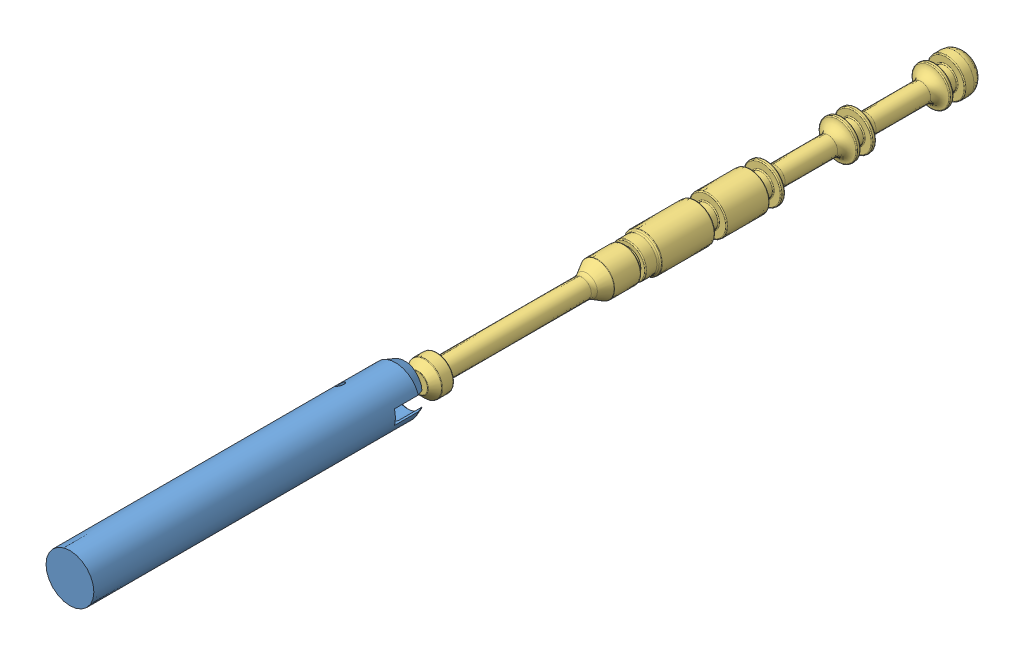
SolidWorks assembly Assem4.SLDASM, configuration Default (file format 12000). Lengths in mm.
Overall size (6.86 5.66 92.83).
4 component instances, 4 part files, 7 mates.
Components (placement in the parent):
- OffCenterPart1-1: OffCenterPart1.SLDPRT [Default] at (13.9286 17.793 17.8707) size (5 5 35.13)
- ExtractorPart2-1: ExtractorPart2.SLDPRT [Default] at (12.4522 18.793 19.3761) x (0.05161 0 0.998667) z (0 -1 0) size (13.89 2.48 2)
- P-201428-12revF-1: P-201428-12revF.sldprt [5.7] at (14.4286 17.793 -27.8121) x (0 0 -1) z (0.717176 -0.696892 0) size (57 4 4)
- 7487N11_Precision Stainless Steel Ball Bearing-1: 7487N11_Precision Stainless Steel Ball Bearing.SLDPRT [7487N11] at (12.4157 17.793 27.3886) x (-0.890134 0 -0.4557) z (0 1 0) size (3 3 1)
Mates (geometry in assembly coordinates):
- Width1: width anti-aligned: plane of ExtractorPart2-1 through (12.4157 18.793 27.3886) normal (0 1 0); plane of ExtractorPart2-1 through (12.4157 16.793 27.3886) normal (0 -1 0); plane of OffCenterPart1-1 through (11.2016 18.343 47.8707) normal (0 -1 0); plane of OffCenterPart1-1 through (12.7016 17.243 47.8707) normal (0 1 0)
- Concentric2: concentric aligned: cylinder of OffCenterPart1-1 through (14.4286 17.793 21.3707) axis (0 0 -1) radius 1.8125; cylinder of P-201428-12revF-1 through (14.4286 17.793 -27.8121) axis (0 0 -1) radius 1.7859
- Concentric3: concentric aligned: cylinder of OffCenterPart1-1 through (12.6586 15.293 23.3707) axis (0 1 0) radius 0.3969; cylinder of ExtractorPart2-1 through (12.6586 16.793 23.3707) axis (0 1 0) radius 0.3969
- Coincident3: coincident aligned: plane of ExtractorPart2-1 through (12.4157 18.793 27.3886) normal (0 1 0); plane of 57155K339_Stainless Steel Ball Bearing-1 through (9.3054 18.293 24.3787) normal (0 1 0)
- Concentric4: concentric aligned: cylinder of ExtractorPart2-1 through (12.4157 16.793 27.3886) axis (0 1 0) radius 0.5; cylinder of 7487N11_Precision Stainless Steel Ball Bearing-1 through (12.4157 18.293 27.3886) axis (0 1 0) radius 0.5
- Width2: width anti-aligned: plane of 7487N11_Precision Stainless Steel Ball Bearing-1 through (11.7549 18.293 28.6793) normal (0 1 0); plane of ExtractorPart2-1 through (11.7549 17.293 28.6793) normal (0 -1 0); plane of 7487N11_Precision Stainless Steel Ball Bearing-1 through (10.4989 18.343 25.5043) normal (0 -1 0); plane of ExtractorPart2-1 through (10.4989 17.243 25.5043) normal (0 1 0)
- Parallel1: parallel aligned: plane of OffCenterPart1-1 through (11.4286 16.743 24.3707) normal (0 1 0)
